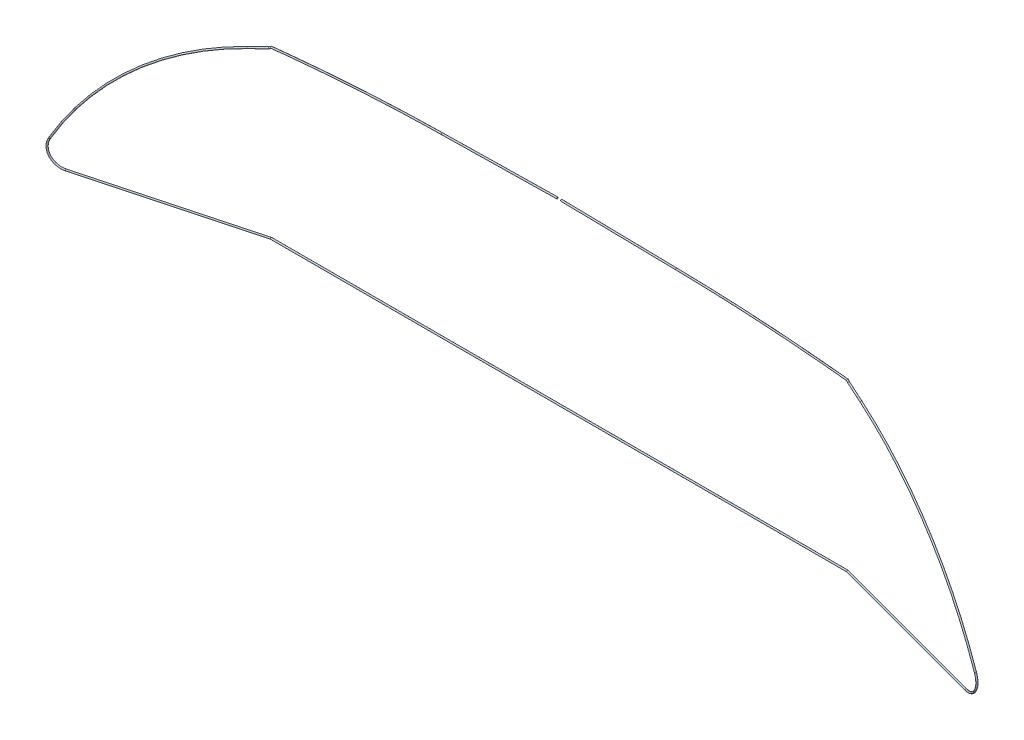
ISO-10303-21;
HEADER;
FILE_DESCRIPTION(('STEP AP214'),'2;1');
FILE_NAME('part.step','',(''),(''),'','','');
FILE_SCHEMA(('AUTOMOTIVE_DESIGN { 1 0 10303 214 1 1 1 1 }'));
ENDSEC;
DATA;
#1=APPLICATION_CONTEXT('core data for automotive mechanical design processes');
#2=APPLICATION_PROTOCOL_DEFINITION('international standard','automotive_design',2000,#1);
#3=PRODUCT_CONTEXT('',#1,'mechanical');
#4=PRODUCT('Part','Part','',(#3));
#5=PRODUCT_RELATED_PRODUCT_CATEGORY('part','',(#4));
#6=PRODUCT_DEFINITION_FORMATION('','',#4);
#7=PRODUCT_DEFINITION_CONTEXT('part definition',#1,'design');
#8=PRODUCT_DEFINITION('design','',#6,#7);
#9=PRODUCT_DEFINITION_SHAPE('','',#8);
#10=(LENGTH_UNIT() NAMED_UNIT(*) SI_UNIT(.MILLI.,.METRE.));
#11=(NAMED_UNIT(*) PLANE_ANGLE_UNIT() SI_UNIT($,.RADIAN.));
#12=(NAMED_UNIT(*) SI_UNIT($,.STERADIAN.) SOLID_ANGLE_UNIT());
#13=UNCERTAINTY_MEASURE_WITH_UNIT(LENGTH_MEASURE(1.E-05),#10,'distance_accuracy_value','');
#14=(GEOMETRIC_REPRESENTATION_CONTEXT(3) GLOBAL_UNCERTAINTY_ASSIGNED_CONTEXT((#13)) GLOBAL_UNIT_ASSIGNED_CONTEXT((#10,
#11,#12)) REPRESENTATION_CONTEXT('',''));
#15=CARTESIAN_POINT('',(0.,0.,0.));
#16=DIRECTION('',(0.,0.,1.));
#17=DIRECTION('',(1.,0.,0.));
#18=AXIS2_PLACEMENT_3D('',#15,#16,#17);
#19=CARTESIAN_POINT('',(-60.3929580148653,-1.09811433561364,-0.193649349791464));
#20=DIRECTION('',(0.999847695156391,0.0174524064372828,0.));
#21=DIRECTION('',(-0.0174524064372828,0.999847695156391,0.));
#22=AXIS2_PLACEMENT_3D('',#19,#20,#21);
#23=CYLINDRICAL_SURFACE('',#22,0.400000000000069);
#24=CARTESIAN_POINT('',(-60.3929580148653,-1.09811433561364,-0.193649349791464));
#25=DIRECTION('',(-0.999847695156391,-0.0174524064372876,0.));
#26=DIRECTION('',(0.0174524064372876,-0.999847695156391,0.));
#27=AXIS2_PLACEMENT_3D('',#24,#25,#26);
#28=CIRCLE('',#27,0.400000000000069);
#29=CARTESIAN_POINT('',(-60.3859770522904,-1.49805341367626,-0.193649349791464));
#30=VERTEX_POINT('',#29);
#31=EDGE_CURVE('E62',#30,#30,#28,.T.);
#32=ORIENTED_EDGE('',*,*,#31,.F.);
#33=EDGE_LOOP('',(#32));
#34=FACE_BOUND('',#33,.T.);
#35=CARTESIAN_POINT('',(-0.998495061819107,-0.0613801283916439,-0.193649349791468));
#36=DIRECTION('',(-0.999847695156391,-0.0174524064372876,0.));
#37=DIRECTION('',(0.0174524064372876,-0.999847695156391,0.));
#38=AXIS2_PLACEMENT_3D('',#35,#36,#37);
#39=CIRCLE('',#38,0.400000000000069);
#40=CARTESIAN_POINT('',(-0.991514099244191,-0.461319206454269,-0.193649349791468));
#41=VERTEX_POINT('',#40);
#42=EDGE_CURVE('E11',#41,#41,#39,.T.);
#43=ORIENTED_EDGE('',*,*,#42,.T.);
#44=EDGE_LOOP('',(#43));
#45=FACE_BOUND('',#44,.T.);
#46=ADVANCED_FACE('F31',(#34,#45),#23,.T.);
#47=CARTESIAN_POINT('',(-149.415925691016,-7.08104666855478,0.0290797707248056));
#48=DIRECTION('',(0.818640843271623,0.530764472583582,-0.219354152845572));
#49=DIRECTION('',(-0.544013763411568,0.839076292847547,0.));
#50=AXIS2_PLACEMENT_3D('',#47,#48,#49);
#51=CYLINDRICAL_SURFACE('',#50,0.399999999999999);
#52=CARTESIAN_POINT('',(-149.415925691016,-7.08104666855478,0.0290797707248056));
#53=DIRECTION('',(0.872724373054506,0.428565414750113,-0.233845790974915));
#54=DIRECTION('',(0.413962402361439,-0.903510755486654,-0.11092089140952));
#55=AXIS2_PLACEMENT_3D('',#52,#53,#54);
#56=ELLIPSE('',#55,0.402734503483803,0.399999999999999);
#57=CARTESIAN_POINT('',(-149.24920874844,-7.44492162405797,-0.0155918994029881));
#58=VERTEX_POINT('',#57);
#59=EDGE_CURVE('E41',#58,#58,#56,.F.);
#60=ORIENTED_EDGE('',*,*,#59,.F.);
#61=EDGE_LOOP('',(#60));
#62=FACE_BOUND('',#61,.T.);
#63=CARTESIAN_POINT('',(-148.584689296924,-6.54211589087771,-0.193649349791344));
#64=DIRECTION('',(0.937469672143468,0.329068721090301,-0.113421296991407));
#65=DIRECTION('',(-0.344875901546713,0.834151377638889,-0.43040921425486));
#66=AXIS2_PLACEMENT_3D('',#63,#64,#65);
#67=ELLIPSE('',#66,0.41365543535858,0.399999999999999);
#68=CARTESIAN_POINT('',(-148.727349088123,-6.19706463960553,-0.371690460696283));
#69=VERTEX_POINT('',#68);
#70=EDGE_CURVE('E37',#69,#69,#67,.T.);
#71=ORIENTED_EDGE('',*,*,#70,.F.);
#72=EDGE_LOOP('',(#71));
#73=FACE_BOUND('',#72,.T.);
#74=ADVANCED_FACE('F125',(#62,#73),#51,.T.);
#75=CARTESIAN_POINT('',(-158.249780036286,-10.1759058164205,2.39610390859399));
#76=DIRECTION('',(0.9149565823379,0.320546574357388,-0.245161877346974));
#77=DIRECTION('',(-0.330636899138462,0.943758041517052,0.));
#78=AXIS2_PLACEMENT_3D('',#75,#76,#77);
#79=CYLINDRICAL_SURFACE('',#78,0.399999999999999);
#80=CARTESIAN_POINT('',(-158.249780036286,-10.1759058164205,2.39610390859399));
#81=DIRECTION('',(0.914956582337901,0.320546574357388,-0.245161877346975));
#82=DIRECTION('',(0.258819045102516,0.,0.96592582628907));
#83=AXIS2_PLACEMENT_3D('',#80,#81,#82);
#84=CIRCLE('',#83,0.399999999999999);
#85=CARTESIAN_POINT('',(-158.373629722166,-9.79701271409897,2.42928933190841));
#86=VERTEX_POINT('',#85);
#87=EDGE_CURVE('E45',#86,#86,#84,.T.);
#88=ORIENTED_EDGE('',*,*,#87,.T.);
#89=EDGE_LOOP('',(#88));
#90=FACE_BOUND('',#89,.T.);
#91=ORIENTED_EDGE('',*,*,#59,.T.);
#92=EDGE_LOOP('',(#91));
#93=FACE_BOUND('',#92,.T.);
#94=ADVANCED_FACE('F130',(#90,#93),#79,.T.);
#95=CARTESIAN_POINT('',(-111.835537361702,-152.170907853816,-10.0405549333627));
#96=DIRECTION('',(-0.258819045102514,0.,-0.96592582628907));
#97=DIRECTION('',(-0.96592582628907,0.,0.258819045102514));
#98=AXIS2_PLACEMENT_3D('',#95,#96,#97);
#99=TOROIDAL_SURFACE('',#98,149.90508,0.399999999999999);
#100=CARTESIAN_POINT('',(-238.696612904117,-79.9052692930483,23.9517678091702));
#101=DIRECTION('',(0.465649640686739,0.876129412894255,-0.124770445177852));
#102=DIRECTION('',(0.258819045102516,0.,0.96592582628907));
#103=AXIS2_PLACEMENT_3D('',#100,#101,#102);
#104=CIRCLE('',#103,0.399999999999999);
#105=CARTESIAN_POINT('',(-239.035123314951,-79.7124389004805,24.0424714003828));
#106=VERTEX_POINT('',#105);
#107=EDGE_CURVE('E50',#106,#106,#104,.T.);
#108=CARTESIAN_POINT('',(-111.835537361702,-152.170907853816,-10.0405549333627));
#109=DIRECTION('',(-0.258819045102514,0.,-0.96592582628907));
#110=DIRECTION('',(-0.96592582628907,0.,0.258819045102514));
#111=AXIS2_PLACEMENT_3D('',#108,#109,#110);
#112=CIRCLE('',#111,150.30508);
#113=EDGE_CURVE('',#106,#86,#112,.T.);
#114=ORIENTED_EDGE('',*,*,#107,.T.);
#115=ORIENTED_EDGE('',*,*,#87,.F.);
#116=ORIENTED_EDGE('',*,*,#113,.T.);
#117=ORIENTED_EDGE('',*,*,#113,.F.);
#118=EDGE_LOOP('',(#114,#116,#115,#117));
#119=FACE_BOUND('',#118,.T.);
#120=ADVANCED_FACE('F162',(#119),#99,.T.);
#121=CARTESIAN_POINT('',(-238.847491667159,-80.1891508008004,23.9921956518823));
#122=DIRECTION('',(0.465649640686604,0.87612941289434,-0.124770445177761));
#123=DIRECTION('',(-0.883029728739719,0.469317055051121,0.));
#124=AXIS2_PLACEMENT_3D('',#121,#122,#123);
#125=CYLINDRICAL_SURFACE('',#124,0.399999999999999);
#126=CARTESIAN_POINT('',(-238.847491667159,-80.1891508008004,23.9921956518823));
#127=DIRECTION('',(0.465649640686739,0.876129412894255,-0.124770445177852));
#128=DIRECTION('',(0.258819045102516,0.,0.96592582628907));
#129=AXIS2_PLACEMENT_3D('',#126,#127,#128);
#130=CIRCLE('',#129,0.399999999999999);
#131=CARTESIAN_POINT('',(-239.186002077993,-79.9963204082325,24.0828992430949));
#132=VERTEX_POINT('',#131);
#133=EDGE_CURVE('E53',#132,#132,#130,.T.);
#134=ORIENTED_EDGE('',*,*,#133,.T.);
#135=EDGE_LOOP('',(#134));
#136=FACE_BOUND('',#135,.T.);
#137=ORIENTED_EDGE('',*,*,#107,.F.);
#138=EDGE_LOOP('',(#137));
#139=FACE_BOUND('',#138,.T.);
#140=ADVANCED_FACE('F158',(#136,#139),#125,.T.);
#141=CARTESIAN_POINT('',(-232.157611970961,-84.,22.1996477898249));
#142=DIRECTION('',(-0.258819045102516,0.,-0.96592582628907));
#143=DIRECTION('',(-0.96592582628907,0.,0.258819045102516));
#144=AXIS2_PLACEMENT_3D('',#141,#142,#143);
#145=TOROIDAL_SURFACE('',#144,7.90508000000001,0.399999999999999);
#146=CARTESIAN_POINT('',(-232.157611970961,-91.90508,22.1996477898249));
#147=DIRECTION('',(-0.96592582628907,0.,0.258819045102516));
#148=DIRECTION('',(0.258819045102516,0.,0.96592582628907));
#149=AXIS2_PLACEMENT_3D('',#146,#147,#148);
#150=CIRCLE('',#149,0.399999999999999);
#151=CARTESIAN_POINT('',(-232.157611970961,-92.30508,22.1996477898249));
#152=VERTEX_POINT('',#151);
#153=EDGE_CURVE('E56',#152,#152,#150,.T.);
#154=CARTESIAN_POINT('',(-232.157611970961,-84.,22.1996477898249));
#155=DIRECTION('',(-0.258819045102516,0.,-0.96592582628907));
#156=DIRECTION('',(-0.96592582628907,0.,0.258819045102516));
#157=AXIS2_PLACEMENT_3D('',#154,#155,#156);
#158=CIRCLE('',#157,8.30508000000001);
#159=EDGE_CURVE('',#152,#132,#158,.T.);
#160=ORIENTED_EDGE('',*,*,#153,.T.);
#161=ORIENTED_EDGE('',*,*,#133,.F.);
#162=ORIENTED_EDGE('',*,*,#159,.T.);
#163=ORIENTED_EDGE('',*,*,#159,.F.);
#164=EDGE_LOOP('',(#160,#162,#161,#163));
#165=FACE_BOUND('',#164,.T.);
#166=ADVANCED_FACE('F151',(#165),#145,.T.);
#167=CARTESIAN_POINT('',(-148.613192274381,-91.90508,-0.186012));
#168=DIRECTION('',(-0.96592582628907,0.,0.258819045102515));
#169=DIRECTION('',(0.258819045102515,0.,0.96592582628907));
#170=AXIS2_PLACEMENT_3D('',#167,#168,#169);
#171=CYLINDRICAL_SURFACE('',#170,0.399999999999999);
#172=CARTESIAN_POINT('',(-148.613192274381,-91.90508,-0.186012));
#173=DIRECTION('',(-0.991444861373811,0.,0.130526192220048));
#174=DIRECTION('',(0.130526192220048,0.,0.991444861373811));
#175=AXIS2_PLACEMENT_3D('',#172,#173,#174);
#176=ELLIPSE('',#175,0.40345158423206,0.399999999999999);
#177=CARTESIAN_POINT('',(-148.560531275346,-91.90508,0.213987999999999));
#178=VERTEX_POINT('',#177);
#179=EDGE_CURVE('E59',#178,#178,#176,.F.);
#180=ORIENTED_EDGE('',*,*,#179,.F.);
#181=EDGE_LOOP('',(#180));
#182=FACE_BOUND('',#181,.T.);
#183=ORIENTED_EDGE('',*,*,#153,.F.);
#184=EDGE_LOOP('',(#183));
#185=FACE_BOUND('',#184,.T.);
#186=ADVANCED_FACE('F145',(#182,#185),#171,.T.);
#187=CARTESIAN_POINT('',(-149.74456312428,-91.90508,-0.186012));
#188=DIRECTION('',(1.,0.,0.));
#189=DIRECTION('',(0.,0.,-1.));
#190=AXIS2_PLACEMENT_3D('',#187,#188,#189);
#191=CYLINDRICAL_SURFACE('',#190,0.399999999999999);
#192=ORIENTED_EDGE('',*,*,#179,.T.);
#193=EDGE_LOOP('',(#192));
#194=FACE_BOUND('',#193,.T.);
#195=CARTESIAN_POINT('',(148.613192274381,-91.90508,-0.186012));
#196=DIRECTION('',(0.991444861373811,0.,0.130526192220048));
#197=DIRECTION('',(-0.130526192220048,0.,0.991444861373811));
#198=AXIS2_PLACEMENT_3D('',#195,#196,#197);
#199=ELLIPSE('',#198,0.40345158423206,0.399999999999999);
#200=CARTESIAN_POINT('',(148.560531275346,-91.90508,0.213987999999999));
#201=VERTEX_POINT('',#200);
#202=EDGE_CURVE('E83',#201,#201,#199,.T.);
#203=ORIENTED_EDGE('',*,*,#202,.F.);
#204=EDGE_LOOP('',(#203));
#205=FACE_BOUND('',#204,.T.);
#206=ADVANCED_FACE('F136',(#194,#205),#191,.T.);
#207=CARTESIAN_POINT('',(-0.992243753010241,-0.419517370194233,-0.0156082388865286));
#208=DIRECTION('',(-0.999847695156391,-0.0174524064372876,0.));
#209=DIRECTION('',(0.0174524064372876,-0.999847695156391,0.));
#210=AXIS2_PLACEMENT_3D('',#207,#208,#209);
#211=PLANE('',#210);
#212=ORIENTED_EDGE('',*,*,#42,.F.);
#213=EDGE_LOOP('',(#212));
#214=FACE_BOUND('',#213,.T.);
#215=ADVANCED_FACE('F113',(#214),#211,.F.);
#216=CARTESIAN_POINT('',(-148.727349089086,-6.19706463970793,-0.371690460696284));
#217=CARTESIAN_POINT('',(-131.889279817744,-4.40816553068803,-0.371690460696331));
#218=CARTESIAN_POINT('',(-102.35823750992,-2.0237668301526,-0.371690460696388));
#219=CARTESIAN_POINT('',(-72.9246973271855,-0.958610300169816,-0.371690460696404));
#220=CARTESIAN_POINT('',(-60.3992093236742,-0.73997709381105,-0.371690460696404));
#221=CARTESIAN_POINT('',(-148.764968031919,-5.84297515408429,0.344693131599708));
#222=CARTESIAN_POINT('',(-132.049771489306,-4.06713020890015,0.344693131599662));
#223=CARTESIAN_POINT('',(-102.343875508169,-1.66334618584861,0.344693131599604));
#224=CARTESIAN_POINT('',(-72.9174460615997,-0.602347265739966,0.344693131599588));
#225=CARTESIAN_POINT('',(-60.4054238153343,-0.383949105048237,0.344693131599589));
#226=CARTESIAN_POINT('',(-148.479648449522,-6.53307765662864,0.700775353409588));
#227=CARTESIAN_POINT('',(-131.764451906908,-4.7572327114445,0.700775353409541));
#228=CARTESIAN_POINT('',(-102.377192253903,-2.38730181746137,0.700775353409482));
#229=CARTESIAN_POINT('',(-72.9049434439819,-1.31862174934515,0.700775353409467));
#230=CARTESIAN_POINT('',(-60.3929211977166,-1.10022358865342,0.700775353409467));
#231=CARTESIAN_POINT('',(-148.442029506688,-6.88716714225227,-0.0156082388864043));
#232=CARTESIAN_POINT('',(-131.665396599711,-5.10479511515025,-0.0156082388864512));
#233=CARTESIAN_POINT('',(-102.373386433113,-2.74538816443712,-0.01560823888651));
#234=CARTESIAN_POINT('',(-72.9054618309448,-1.67476726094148,-0.0156082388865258));
#235=CARTESIAN_POINT('',(-60.3867067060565,-1.45625157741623,-0.015608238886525));
#236=CARTESIAN_POINT('',(-148.404410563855,-7.2412566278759,-0.731991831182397));
#237=CARTESIAN_POINT('',(-131.566341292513,-5.452357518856,-0.731991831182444));
#238=CARTESIAN_POINT('',(-102.369580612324,-3.10347451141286,-0.731991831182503));
#239=CARTESIAN_POINT('',(-72.9059802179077,-2.03091277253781,-0.731991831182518));
#240=CARTESIAN_POINT('',(-60.3804922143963,-1.81227956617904,-0.731991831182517));
#241=CARTESIAN_POINT('',(-148.689730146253,-6.55115412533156,-1.08807405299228));
#242=CARTESIAN_POINT('',(-131.728788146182,-4.7492008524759,-1.08807405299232));
#243=CARTESIAN_POINT('',(-102.372599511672,-2.38418747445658,-1.08807405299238));
#244=CARTESIAN_POINT('',(-72.9319485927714,-1.31487333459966,-1.0880740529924));
#245=CARTESIAN_POINT('',(-60.3929948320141,-1.09600508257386,-1.0880740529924));
#246=CARTESIAN_POINT('',(-148.727349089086,-6.19706463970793,-0.371690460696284));
#247=CARTESIAN_POINT('',(-131.889279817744,-4.40816553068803,-0.371690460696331));
#248=CARTESIAN_POINT('',(-102.35823750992,-2.0237668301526,-0.371690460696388));
#249=CARTESIAN_POINT('',(-72.9246973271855,-0.958610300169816,-0.371690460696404));
#250=CARTESIAN_POINT('',(-60.3992093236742,-0.73997709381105,-0.371690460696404));
#251=(BOUNDED_SURFACE() B_SPLINE_SURFACE(3,3,((#216,#217,#218,#219,#220),(#221,#222,#223,#224,
#225),(#226,#227,#228,#229,#230),(#231,#232,#233,#234,#235),(#236,#237,#238,#239,#240),(#241,
#242,#243,#244,#245),(#246,#247,#248,#249,#250)),.UNSPECIFIED.,.T.,.F.,
.F.) B_SPLINE_SURFACE_WITH_KNOTS((4,3,4),(4,1,4),(0.,0.5,1.),(0.,0.574841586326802,1.),
.UNSPECIFIED.) GEOMETRIC_REPRESENTATION_ITEM() RATIONAL_B_SPLINE_SURFACE(((1.,1.,1.,1.,1.),
(0.333333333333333,0.333333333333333,0.333333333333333,0.333333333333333,0.333333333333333),
(0.333333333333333,0.333333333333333,0.333333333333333,0.333333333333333,0.333333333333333),(1.,
1.,1.,1.,1.),(0.333333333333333,0.333333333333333,0.333333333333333,0.333333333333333,
0.333333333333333),(0.333333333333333,0.333333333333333,0.333333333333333,0.333333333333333,
0.333333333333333),(1.,1.,1.,1.,1.))) REPRESENTATION_ITEM('') SURFACE());
#252=ORIENTED_EDGE('',*,*,#70,.T.);
#253=EDGE_LOOP('',(#252));
#254=FACE_BOUND('',#253,.T.);
#255=ORIENTED_EDGE('',*,*,#31,.T.);
#256=EDGE_LOOP('',(#255));
#257=FACE_BOUND('',#256,.T.);
#258=ADVANCED_FACE('F111',(#254,#257),#251,.T.);
#259=CARTESIAN_POINT('',(60.3929580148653,-1.09811433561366,-0.193649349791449));
#260=DIRECTION('',(-0.999847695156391,0.0174524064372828,0.));
#261=DIRECTION('',(-0.0174524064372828,-0.999847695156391,0.));
#262=AXIS2_PLACEMENT_3D('',#259,#260,#261);
#263=CYLINDRICAL_SURFACE('',#262,0.400000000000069);
#264=CARTESIAN_POINT('',(60.3929580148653,-1.09811433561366,-0.193649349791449));
#265=DIRECTION('',(-0.999847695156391,0.017452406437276,0.));
#266=DIRECTION('',(-0.017452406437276,-0.999847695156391,0.));
#267=AXIS2_PLACEMENT_3D('',#264,#265,#266);
#268=CIRCLE('',#267,0.400000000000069);
#269=CARTESIAN_POINT('',(60.3859770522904,-1.49805341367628,-0.193649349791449));
#270=VERTEX_POINT('',#269);
#271=EDGE_CURVE('E86',#270,#270,#268,.T.);
#272=ORIENTED_EDGE('',*,*,#271,.T.);
#273=EDGE_LOOP('',(#272));
#274=FACE_BOUND('',#273,.T.);
#275=CARTESIAN_POINT('',(0.998495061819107,-0.0613801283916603,-0.193649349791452));
#276=DIRECTION('',(-0.999847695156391,0.017452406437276,0.));
#277=DIRECTION('',(-0.017452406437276,-0.999847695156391,0.));
#278=AXIS2_PLACEMENT_3D('',#275,#276,#277);
#279=CIRCLE('',#278,0.400000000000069);
#280=CARTESIAN_POINT('',(0.991514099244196,-0.461319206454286,-0.193649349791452));
#281=VERTEX_POINT('',#280);
#282=EDGE_CURVE('E65',#281,#281,#279,.T.);
#283=ORIENTED_EDGE('',*,*,#282,.F.);
#284=EDGE_LOOP('',(#283));
#285=FACE_BOUND('',#284,.T.);
#286=ADVANCED_FACE('F108',(#274,#285),#263,.T.);
#287=CARTESIAN_POINT('',(149.415925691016,-7.0810466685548,0.0290797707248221));
#288=DIRECTION('',(-0.818640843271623,0.530764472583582,-0.219354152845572));
#289=DIRECTION('',(-0.544013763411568,-0.839076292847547,0.));
#290=AXIS2_PLACEMENT_3D('',#287,#288,#289);
#291=CYLINDRICAL_SURFACE('',#290,0.399999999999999);
#292=CARTESIAN_POINT('',(149.415925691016,-7.0810466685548,0.0290797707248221));
#293=DIRECTION('',(-0.872724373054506,0.428565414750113,-0.233845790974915));
#294=DIRECTION('',(-0.413962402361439,-0.903510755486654,-0.11092089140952));
#295=AXIS2_PLACEMENT_3D('',#292,#293,#294);
#296=ELLIPSE('',#295,0.402734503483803,0.399999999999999);
#297=CARTESIAN_POINT('',(149.24920874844,-7.44492162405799,-0.0155918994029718));
#298=VERTEX_POINT('',#297);
#299=EDGE_CURVE('E68',#298,#298,#296,.T.);
#300=ORIENTED_EDGE('',*,*,#299,.T.);
#301=EDGE_LOOP('',(#300));
#302=FACE_BOUND('',#301,.T.);
#303=CARTESIAN_POINT('',(148.727349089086,-6.19706463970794,-0.371690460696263));
#304=CARTESIAN_POINT('',(148.764968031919,-5.84297515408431,0.344693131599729));
#305=CARTESIAN_POINT('',(148.479648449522,-6.53307765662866,0.700775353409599));
#306=CARTESIAN_POINT('',(148.442029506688,-6.88716714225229,-0.0156082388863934));
#307=CARTESIAN_POINT('',(148.404410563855,-7.24125662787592,-0.731991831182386));
#308=CARTESIAN_POINT('',(148.689730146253,-6.55115412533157,-1.08807405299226));
#309=CARTESIAN_POINT('',(148.727349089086,-6.19706463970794,-0.371690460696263));
#310=(BOUNDED_CURVE() B_SPLINE_CURVE(3,(#303,#304,#305,#306,#307,#308,#309),.UNSPECIFIED.,.T.,
.F.) B_SPLINE_CURVE_WITH_KNOTS((4,3,4),(0.,0.5,1.),
.UNSPECIFIED.) CURVE() GEOMETRIC_REPRESENTATION_ITEM() RATIONAL_B_SPLINE_CURVE((1.,
0.333333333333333,0.333333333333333,1.,0.333333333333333,0.333333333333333,1.)) REPRESENTATION_ITEM(''));
#311=CARTESIAN_POINT('',(148.727349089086,-6.19706463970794,-0.371690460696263));
#312=VERTEX_POINT('',#311);
#313=EDGE_CURVE('E89',#312,#312,#310,.T.);
#314=ORIENTED_EDGE('',*,*,#313,.T.);
#315=EDGE_LOOP('',(#314));
#316=FACE_BOUND('',#315,.T.);
#317=ADVANCED_FACE('F98',(#302,#316),#291,.T.);
#318=CARTESIAN_POINT('',(158.249780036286,-10.1759058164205,2.39610390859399));
#319=DIRECTION('',(-0.9149565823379,0.320546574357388,-0.245161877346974));
#320=DIRECTION('',(-0.330636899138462,-0.943758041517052,0.));
#321=AXIS2_PLACEMENT_3D('',#318,#319,#320);
#322=CYLINDRICAL_SURFACE('',#321,0.399999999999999);
#323=CARTESIAN_POINT('',(158.249780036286,-10.1759058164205,2.39610390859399));
#324=DIRECTION('',(-0.914956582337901,0.320546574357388,-0.245161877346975));
#325=DIRECTION('',(0.258819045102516,0.,-0.96592582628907));
#326=AXIS2_PLACEMENT_3D('',#323,#324,#325);
#327=CIRCLE('',#326,0.399999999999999);
#328=CARTESIAN_POINT('',(158.373629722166,-9.79701271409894,2.42928933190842));
#329=VERTEX_POINT('',#328);
#330=EDGE_CURVE('E71',#329,#329,#327,.F.);
#331=ORIENTED_EDGE('',*,*,#330,.F.);
#332=EDGE_LOOP('',(#331));
#333=FACE_BOUND('',#332,.T.);
#334=ORIENTED_EDGE('',*,*,#299,.F.);
#335=EDGE_LOOP('',(#334));
#336=FACE_BOUND('',#335,.T.);
#337=ADVANCED_FACE('F216',(#333,#336),#322,.T.);
#338=CARTESIAN_POINT('',(111.835537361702,-152.170907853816,-10.0405549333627));
#339=DIRECTION('',(-0.258819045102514,0.,0.96592582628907));
#340=DIRECTION('',(0.96592582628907,0.,0.258819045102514));
#341=AXIS2_PLACEMENT_3D('',#338,#339,#340);
#342=TOROIDAL_SURFACE('',#341,149.90508,0.399999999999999);
#343=CARTESIAN_POINT('',(238.696612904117,-79.9052692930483,23.9517678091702));
#344=DIRECTION('',(-0.465649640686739,0.876129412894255,-0.124770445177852));
#345=DIRECTION('',(0.258819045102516,0.,-0.96592582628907));
#346=AXIS2_PLACEMENT_3D('',#343,#344,#345);
#347=CIRCLE('',#346,0.399999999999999);
#348=CARTESIAN_POINT('',(239.035123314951,-79.7124389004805,24.0424714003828));
#349=VERTEX_POINT('',#348);
#350=EDGE_CURVE('E74',#349,#349,#347,.F.);
#351=CARTESIAN_POINT('',(111.835537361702,-152.170907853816,-10.0405549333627));
#352=DIRECTION('',(-0.258819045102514,0.,0.96592582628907));
#353=DIRECTION('',(0.96592582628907,0.,0.258819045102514));
#354=AXIS2_PLACEMENT_3D('',#351,#352,#353);
#355=CIRCLE('',#354,150.30508);
#356=EDGE_CURVE('',#349,#329,#355,.T.);
#357=ORIENTED_EDGE('',*,*,#350,.F.);
#358=ORIENTED_EDGE('',*,*,#330,.T.);
#359=ORIENTED_EDGE('',*,*,#356,.T.);
#360=ORIENTED_EDGE('',*,*,#356,.F.);
#361=EDGE_LOOP('',(#357,#359,#358,#360));
#362=FACE_BOUND('',#361,.T.);
#363=ADVANCED_FACE('F224',(#362),#342,.T.);
#364=CARTESIAN_POINT('',(238.847491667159,-80.1891508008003,23.9921956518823));
#365=DIRECTION('',(-0.465649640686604,0.87612941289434,-0.124770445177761));
#366=DIRECTION('',(-0.883029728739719,-0.469317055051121,0.));
#367=AXIS2_PLACEMENT_3D('',#364,#365,#366);
#368=CYLINDRICAL_SURFACE('',#367,0.399999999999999);
#369=CARTESIAN_POINT('',(238.847491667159,-80.1891508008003,23.9921956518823));
#370=DIRECTION('',(-0.465649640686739,0.876129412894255,-0.124770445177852));
#371=DIRECTION('',(0.258819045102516,0.,-0.96592582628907));
#372=AXIS2_PLACEMENT_3D('',#369,#370,#371);
#373=CIRCLE('',#372,0.399999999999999);
#374=CARTESIAN_POINT('',(239.186002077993,-79.9963204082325,24.0828992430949));
#375=VERTEX_POINT('',#374);
#376=EDGE_CURVE('E77',#375,#375,#373,.F.);
#377=ORIENTED_EDGE('',*,*,#376,.F.);
#378=EDGE_LOOP('',(#377));
#379=FACE_BOUND('',#378,.T.);
#380=ORIENTED_EDGE('',*,*,#350,.T.);
#381=EDGE_LOOP('',(#380));
#382=FACE_BOUND('',#381,.T.);
#383=ADVANCED_FACE('F232',(#379,#382),#368,.T.);
#384=CARTESIAN_POINT('',(232.157611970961,-84.,22.1996477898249));
#385=DIRECTION('',(-0.258819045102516,0.,0.96592582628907));
#386=DIRECTION('',(0.96592582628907,0.,0.258819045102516));
#387=AXIS2_PLACEMENT_3D('',#384,#385,#386);
#388=TOROIDAL_SURFACE('',#387,7.90508000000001,0.399999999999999);
#389=CARTESIAN_POINT('',(232.157611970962,-91.90508,22.1996477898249));
#390=DIRECTION('',(0.96592582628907,0.,0.258819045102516));
#391=DIRECTION('',(0.258819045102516,0.,-0.96592582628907));
#392=AXIS2_PLACEMENT_3D('',#389,#390,#391);
#393=CIRCLE('',#392,0.399999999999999);
#394=CARTESIAN_POINT('',(232.157611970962,-92.30508,22.1996477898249));
#395=VERTEX_POINT('',#394);
#396=EDGE_CURVE('E80',#395,#395,#393,.F.);
#397=CARTESIAN_POINT('',(232.157611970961,-84.,22.1996477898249));
#398=DIRECTION('',(-0.258819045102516,0.,0.96592582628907));
#399=DIRECTION('',(0.96592582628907,0.,0.258819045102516));
#400=AXIS2_PLACEMENT_3D('',#397,#398,#399);
#401=CIRCLE('',#400,8.30508000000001);
#402=EDGE_CURVE('',#395,#375,#401,.T.);
#403=ORIENTED_EDGE('',*,*,#396,.F.);
#404=ORIENTED_EDGE('',*,*,#376,.T.);
#405=ORIENTED_EDGE('',*,*,#402,.T.);
#406=ORIENTED_EDGE('',*,*,#402,.F.);
#407=EDGE_LOOP('',(#403,#405,#404,#406));
#408=FACE_BOUND('',#407,.T.);
#409=ADVANCED_FACE('F121',(#408),#388,.T.);
#410=CARTESIAN_POINT('',(148.613192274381,-91.90508,-0.186012));
#411=DIRECTION('',(0.96592582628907,0.,0.258819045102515));
#412=DIRECTION('',(0.258819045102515,0.,-0.96592582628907));
#413=AXIS2_PLACEMENT_3D('',#410,#411,#412);
#414=CYLINDRICAL_SURFACE('',#413,0.399999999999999);
#415=ORIENTED_EDGE('',*,*,#202,.T.);
#416=EDGE_LOOP('',(#415));
#417=FACE_BOUND('',#416,.T.);
#418=ORIENTED_EDGE('',*,*,#396,.T.);
#419=EDGE_LOOP('',(#418));
#420=FACE_BOUND('',#419,.T.);
#421=ADVANCED_FACE('F105',(#417,#420),#414,.T.);
#422=CARTESIAN_POINT('',(0.992243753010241,-0.41951737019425,-0.0156082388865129));
#423=DIRECTION('',(-0.999847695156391,0.017452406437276,0.));
#424=DIRECTION('',(-0.017452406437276,-0.999847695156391,0.));
#425=AXIS2_PLACEMENT_3D('',#422,#423,#424);
#426=PLANE('',#425);
#427=ORIENTED_EDGE('',*,*,#282,.T.);
#428=EDGE_LOOP('',(#427));
#429=FACE_BOUND('',#428,.T.);
#430=ADVANCED_FACE('F103',(#429),#426,.T.);
#431=CARTESIAN_POINT('',(148.727349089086,-6.19706463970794,-0.371690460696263));
#432=CARTESIAN_POINT('',(131.889279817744,-4.40816553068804,-0.37169046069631));
#433=CARTESIAN_POINT('',(102.358237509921,-2.02376683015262,-0.371690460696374));
#434=CARTESIAN_POINT('',(72.9246973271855,-0.958610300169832,-0.371690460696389));
#435=CARTESIAN_POINT('',(60.3992093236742,-0.739977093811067,-0.371690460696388));
#436=CARTESIAN_POINT('',(148.764968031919,-5.84297515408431,0.344693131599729));
#437=CARTESIAN_POINT('',(132.049771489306,-4.06713020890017,0.344693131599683));
#438=CARTESIAN_POINT('',(102.343875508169,-1.66334618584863,0.344693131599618));
#439=CARTESIAN_POINT('',(72.9174460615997,-0.602347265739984,0.344693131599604));
#440=CARTESIAN_POINT('',(60.4054238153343,-0.383949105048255,0.344693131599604));
#441=CARTESIAN_POINT('',(148.479648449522,-6.53307765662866,0.700775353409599));
#442=CARTESIAN_POINT('',(131.764451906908,-4.75723271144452,0.700775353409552));
#443=CARTESIAN_POINT('',(102.377192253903,-2.38730181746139,0.7007753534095));
#444=CARTESIAN_POINT('',(72.9049434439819,-1.31862174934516,0.700775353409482));
#445=CARTESIAN_POINT('',(60.3929211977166,-1.10022358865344,0.700775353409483));
#446=CARTESIAN_POINT('',(148.442029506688,-6.88716714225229,-0.0156082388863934));
#447=CARTESIAN_POINT('',(131.665396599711,-5.10479511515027,-0.0156082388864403));
#448=CARTESIAN_POINT('',(102.373386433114,-2.74538816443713,-0.0156082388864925));
#449=CARTESIAN_POINT('',(72.9054618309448,-1.67476726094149,-0.01560823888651));
#450=CARTESIAN_POINT('',(60.3867067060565,-1.45625157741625,-0.0156082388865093));
#451=CARTESIAN_POINT('',(148.404410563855,-7.24125662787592,-0.731991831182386));
#452=CARTESIAN_POINT('',(131.566341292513,-5.45235751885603,-0.731991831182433));
#453=CARTESIAN_POINT('',(102.369580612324,-3.10347451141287,-0.731991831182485));
#454=CARTESIAN_POINT('',(72.9059802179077,-2.03091277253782,-0.731991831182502));
#455=CARTESIAN_POINT('',(60.3804922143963,-1.81227956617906,-0.731991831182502));
#456=CARTESIAN_POINT('',(148.689730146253,-6.55115412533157,-1.08807405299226));
#457=CARTESIAN_POINT('',(131.728788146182,-4.74920085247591,-1.0880740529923));
#458=CARTESIAN_POINT('',(102.372599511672,-2.3841874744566,-1.08807405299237));
#459=CARTESIAN_POINT('',(72.9319485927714,-1.31487333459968,-1.08807405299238));
#460=CARTESIAN_POINT('',(60.3929948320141,-1.09600508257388,-1.08807405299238));
#461=CARTESIAN_POINT('',(148.727349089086,-6.19706463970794,-0.371690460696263));
#462=CARTESIAN_POINT('',(131.889279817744,-4.40816553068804,-0.37169046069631));
#463=CARTESIAN_POINT('',(102.358237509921,-2.02376683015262,-0.371690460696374));
#464=CARTESIAN_POINT('',(72.9246973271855,-0.958610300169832,-0.371690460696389));
#465=CARTESIAN_POINT('',(60.3992093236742,-0.739977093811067,-0.371690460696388));
#466=(BOUNDED_SURFACE() B_SPLINE_SURFACE(3,3,((#431,#432,#433,#434,#435),(#436,#437,#438,#439,
#440),(#441,#442,#443,#444,#445),(#446,#447,#448,#449,#450),(#451,#452,#453,#454,#455),(#456,
#457,#458,#459,#460),(#461,#462,#463,#464,#465)),.UNSPECIFIED.,.T.,.F.,
.F.) B_SPLINE_SURFACE_WITH_KNOTS((4,3,4),(4,1,4),(0.,0.5,1.),(0.,0.574841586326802,1.),
.UNSPECIFIED.) GEOMETRIC_REPRESENTATION_ITEM() RATIONAL_B_SPLINE_SURFACE(((1.,1.,1.,1.,1.),
(0.333333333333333,0.333333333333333,0.333333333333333,0.333333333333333,0.333333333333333),
(0.333333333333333,0.333333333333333,0.333333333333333,0.333333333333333,0.333333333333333),(1.,
1.,1.,1.,1.),(0.333333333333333,0.333333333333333,0.333333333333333,0.333333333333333,
0.333333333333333),(0.333333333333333,0.333333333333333,0.333333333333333,0.333333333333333,
0.333333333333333),(1.,1.,1.,1.,1.))) REPRESENTATION_ITEM('') SURFACE());
#467=ORIENTED_EDGE('',*,*,#313,.F.);
#468=EDGE_LOOP('',(#467));
#469=FACE_BOUND('',#468,.T.);
#470=ORIENTED_EDGE('',*,*,#271,.F.);
#471=EDGE_LOOP('',(#470));
#472=FACE_BOUND('',#471,.T.);
#473=ADVANCED_FACE('F100',(#469,#472),#466,.F.);
#474=CLOSED_SHELL('',(#46,#74,#94,#120,#140,#166,#186,#206,#215,#258,#286,#317,#337,#363,#383,
#409,#421,#430,#473));
#475=MANIFOLD_SOLID_BREP('B2',#474);
#476=ADVANCED_BREP_SHAPE_REPRESENTATION('',(#18,#475),#14);
#477=SHAPE_DEFINITION_REPRESENTATION(#9,#476);
ENDSEC;
END-ISO-10303-21;
